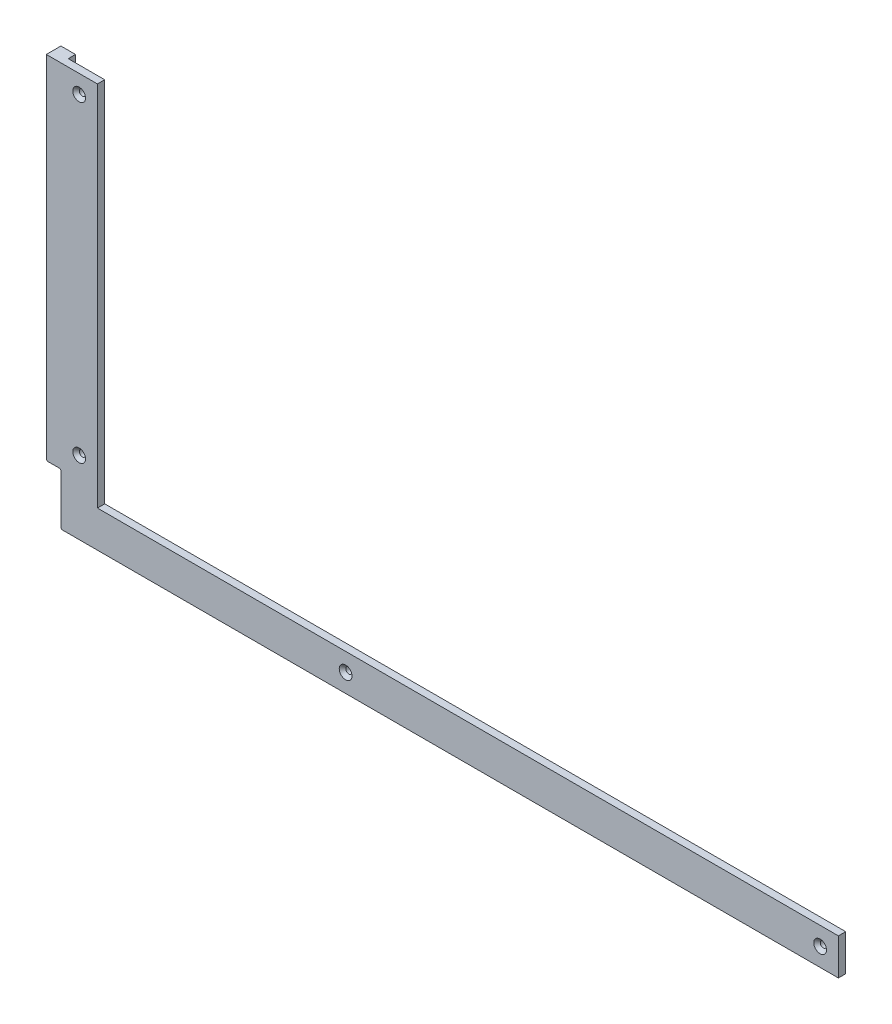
from build123d import *

# Parameters (mm, degrees)
SKIZZE1_W                                            = 832
SKIZZE1_H                                            = 422.5
SKIZZE1_W_2                                          = 792
SKIZZE1_H_2                                          = 382.5
AUFSATZ_LINEAR_AUSTRAGEN1_DEPTH                      = 8
VERRUNDUNG1_R                                        = 1
SKIZZE2_W                                            = 817
SKIZZE2_H                                            = 407.5
SCHNITT_LINEAR_AUSTRAGEN1_DEPTH                      = 4
FORMSENKUNG_F_R_M3_SENKSCHRAUBE_MIT_INNE_D           = 3.4
FORMSENKUNG_F_R_M3_SENKSCHRAUBE_MIT_INNE_CSINK_D     = 7
FORMSENKUNG_F_R_M3_SENKSCHRAUBE_MIT_INNE_CSINK_ANGLE = 90
SCHNITT_LINEAR_AUSTRAGEN2_DEPTH                      = 467.633220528
SCHNITT_LINEAR_AUSTRAGEN3_DEPTH                      = 467.633220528
SCHNITT_LINEAR_AUSTRAGEN4_DEPTH                      = 467.633220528
SCHNITT_LINEAR_AUSTRAGEN4_DEPTH_BACK                 = 467.633220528
SKIZZE8_W                                            = 8
SKIZZE8_H                                            = 192.75
AUFSATZ_LINEAR_AUSTRAGEN2_DEPTH                      = 8
VERRUNDUNG2_R                                        = 1


with BuildPart() as part:
    # Skizze1 → Aufsatz-Linear austragen1 (new body)
    with BuildSketch(Plane.XY):
        Rectangle(SKIZZE1_W, SKIZZE1_H)
        Rectangle(SKIZZE1_W_2, SKIZZE1_H_2, mode=Mode.SUBTRACT)
    extrude(amount=AUFSATZ_LINEAR_AUSTRAGEN1_DEPTH)

    # Verrundung1
    verrundung1_edges = [part.edges().sort_by_distance(p)[0] for p in [
        (416, -211.25, 4),
        (-416, -211.25, 4),
        (-416, 211.25, 4),
        (416, 211.25, 4),
    ]]
    fillet(verrundung1_edges, radius=VERRUNDUNG1_R)

    # Skizze2 → Schnitt-Linear austragen1 (cut)
    with BuildSketch(Plane(origin=(0, 0, 0), x_dir=(-1, 0, 0), z_dir=(0, 0, -1))):
        Rectangle(SKIZZE2_W, SKIZZE2_H)
    extrude(amount=-SCHNITT_LINEAR_AUSTRAGEN1_DEPTH, mode=Mode.SUBTRACT)

    # Formsenkung f_r M3 Senkschraube mit Inne (through all)
    with Locations(Plane.XY.offset(8)):
        with Locations((-260, -201.25), (260, -201.25), (260, 201.25), (-260, 201.25), (406, 171.25), (406, -171.25), (-406, -171.25), (-406, 171.25), (-406, 0), (406, 0), (0, -201.25), (0, 201.25)):
            CounterSinkHole(FORMSENKUNG_F_R_M3_SENKSCHRAUBE_MIT_INNE_D / 2, FORMSENKUNG_F_R_M3_SENKSCHRAUBE_MIT_INNE_CSINK_D / 2, counter_sink_angle=FORMSENKUNG_F_R_M3_SENKSCHRAUBE_MIT_INNE_CSINK_ANGLE)

    # Skizze5 → Schnitt-Linear austragen2 (cut, through all)
    with BuildSketch(Plane(origin=(0, 0, 0), x_dir=(0, 0, -1), z_dir=(1, 0, 0))):
        Polygon((-8, 211.25), (-8, 10), (-4, 10), (-4, -10), (0, -10), (0, 211.25), align=None)
    extrude(amount=-SCHNITT_LINEAR_AUSTRAGEN2_DEPTH, mode=Mode.SUBTRACT)

    # Skizze6 → Schnitt-Linear austragen3 (cut, through all)
    with BuildSketch(Plane(origin=(0, 0, 0), x_dir=(0, 0, -1), z_dir=(1, 0, 0))):
        Polygon((-8, 211.25), (-8, -10), (-4, -10), (-4, 10), (0, 10), (0, 211.25), align=None)
    extrude(amount=SCHNITT_LINEAR_AUSTRAGEN3_DEPTH, mode=Mode.SUBTRACT)

    # Skizze7 → Schnitt-Linear austragen4 (cut, two sides: drawn at the far end of the back side and taken through both)
    with BuildSketch(Plane(origin=(0, 0, 0), x_dir=(1, 0, 0), z_dir=(0, 1, 0)).offset(-SCHNITT_LINEAR_AUSTRAGEN4_DEPTH_BACK)):
        Polygon((416, -8), (10, -8), (10, -4), (-10, -4), (-10, 0), (416, 0), align=None)
    extrude(amount=SCHNITT_LINEAR_AUSTRAGEN4_DEPTH + SCHNITT_LINEAR_AUSTRAGEN4_DEPTH_BACK, mode=Mode.SUBTRACT)

    # Skizze8 → Aufsatz-Linear austragen2 (add)
    with BuildSketch(Plane.XY.offset(8)):
        with Locations((-420, -86.375)):
            Rectangle(SKIZZE8_W, SKIZZE8_H)
    extrude(amount=-AUFSATZ_LINEAR_AUSTRAGEN2_DEPTH)

    # Verrundung2
    verrundung2_edges = [part.edges().sort_by_distance(p)[0] for p in [
        (-424, -182.75, 4),
        (-416, -182.75, 4),
    ]]
    fillet(verrundung2_edges, radius=VERRUNDUNG2_R)


solid = part.part
